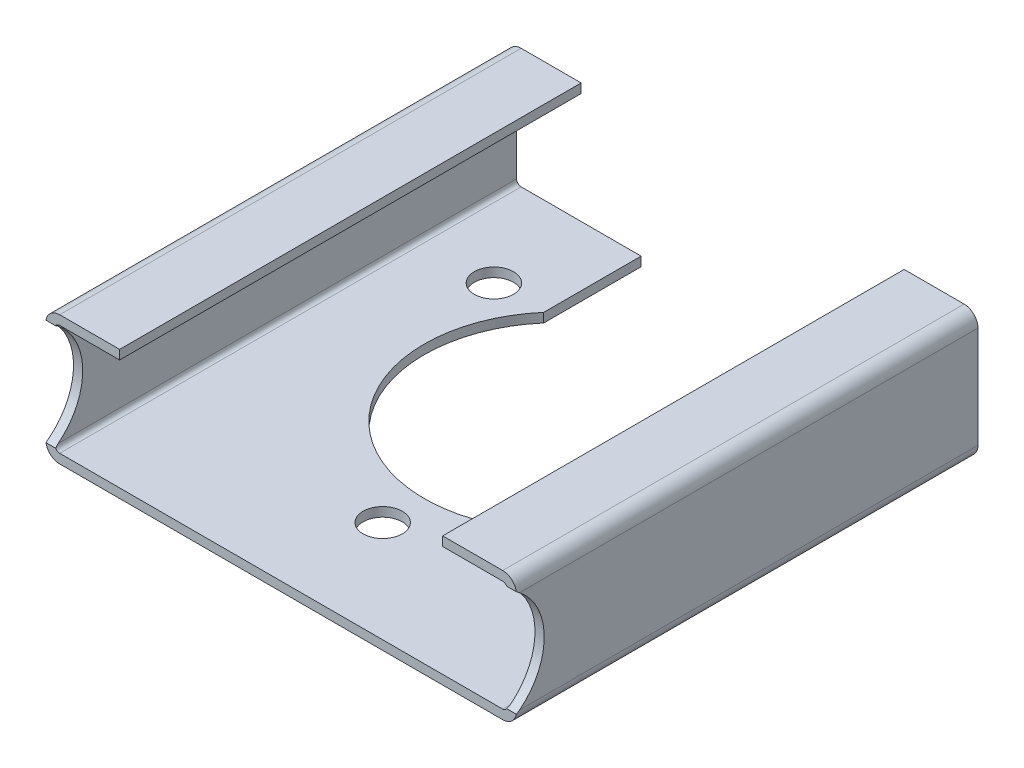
from build123d import *

# Parameters (mm, degrees)
BASE_EXTRUSION_DEPTH    = 100
ESQUISSE2_R             = 14
ENL_V_MAT_EXTRU_1_DEPTH = 146.560983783
ENL_V_MAT_EXTRU_2_REACH = 147.561
ESQUISSE3_R             = 4.25


with BuildPart() as part:
    # Esquisse1 → Base-Extrusion (new body)
    with BuildSketch(Plane.XY):
        with BuildLine():
            Line((2, 3), (2, 25))
            ThreePointArc((2, 25), (2.292893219, 25.707106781), (3, 26))
            Line((3, 26), (16, 26))
            Line((16, 26), (16, 28))
            Line((16, 28), (3, 28))
            ThreePointArc((3, 28), (0.878679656, 27.121320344), (0, 25))
            Line((0, 25), (0, 3))
            ThreePointArc((0, 3), (0.878679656, 0.878679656), (3, 0))
            Line((3, 0), (99, 0))
            ThreePointArc((99, 0), (101.121320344, 0.878679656), (102, 3))
            Line((102, 3), (102, 25))
            ThreePointArc((102, 25), (101.121320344, 27.121320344), (99, 28))
            Line((99, 28), (86, 28))
            Line((86, 28), (86, 26))
            Line((86, 26), (99, 26))
            ThreePointArc((99, 26), (99.707106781, 25.707106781), (100, 25))
            Line((100, 25), (100, 3))
            ThreePointArc((100, 3), (99.707106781, 2.292893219), (99, 2))
            Line((99, 2), (3, 2))
            ThreePointArc((3, 2), (2.292893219, 2.292893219), (2, 3))
        make_face()
    extrude(amount=-BASE_EXTRUSION_DEPTH)

    # Esquisse2 → Enl_v. mat.-Extru.1 (cut, through all)
    with BuildSketch(Plane(origin=(102, 0, 0), x_dir=(0, 0, -1), z_dir=(1, 0, 0))):
        with Locations((-8, 14)):
            Circle(ESQUISSE2_R)
    extrude(amount=-ENL_V_MAT_EXTRU_1_DEPTH, mode=Mode.SUBTRACT)

    # Esquisse3 → Enl_v. mat.-Extru.2 (cut, up to next)
    with BuildSketch(Plane.XZ, mode=Mode.PRIVATE) as enl_v_mat_extru_2_sk1:
        with Locations(Location((51, -22, 0), (0, 0, 270))):
            Circle(ESQUISSE3_R)
    enl_v_mat_extru_2_tool1 = extrude(enl_v_mat_extru_2_sk1.sketch, amount=-ENL_V_MAT_EXTRU_2_REACH, mode=Mode.PRIVATE) & part.part
    # Esquisse3 → Enl_v. mat.-Extru.2 (cut, up to next)
    with BuildSketch(Plane.XZ, mode=Mode.PRIVATE) as enl_v_mat_extru_2_sk2:
        with Locations(Location((83.908965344, -79, 0), (0, 0, 270))):
            Circle(ESQUISSE3_R)
    enl_v_mat_extru_2_tool2 = extrude(enl_v_mat_extru_2_sk2.sketch, amount=-ENL_V_MAT_EXTRU_2_REACH, mode=Mode.PRIVATE) & part.part
    # Esquisse3 → Enl_v. mat.-Extru.2 (cut, up to next)
    with BuildSketch(Plane.XZ, mode=Mode.PRIVATE) as enl_v_mat_extru_2_sk3:
        with Locations(Location((18.091034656, -79, 0), (0, 0, 270))):
            Circle(ESQUISSE3_R)
    enl_v_mat_extru_2_tool3 = extrude(enl_v_mat_extru_2_sk3.sketch, amount=-ENL_V_MAT_EXTRU_2_REACH, mode=Mode.PRIVATE) & part.part
    # Esquisse3 → Enl_v. mat.-Extru.2 (cut, up to next)
    with BuildSketch(Plane.XZ, mode=Mode.PRIVATE) as enl_v_mat_extru_2_sk4:
        with BuildLine():
            Line((29, -100), (73, -100))
            Line((73, -100), (73, -78.894443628))
            ThreePointArc((73, -78.894443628), (51, -31), (29, -78.894443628))
            Line((29, -78.894443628), (29, -100))
        make_face()
    enl_v_mat_extru_2_tool4 = extrude(enl_v_mat_extru_2_sk4.sketch, amount=-ENL_V_MAT_EXTRU_2_REACH, mode=Mode.PRIVATE) & part.part
    add(enl_v_mat_extru_2_tool1.solids().sort_by_distance((51, 0, -22))[0], mode=Mode.SUBTRACT)
    add(enl_v_mat_extru_2_tool2.solids().sort_by_distance((83.908965, 0, -79))[0], mode=Mode.SUBTRACT)
    add(enl_v_mat_extru_2_tool3.solids().sort_by_distance((18.091035, 0, -79))[0], mode=Mode.SUBTRACT)
    add(enl_v_mat_extru_2_tool4.solids().sort_by_distance((51, 0, -66.206768))[0], mode=Mode.SUBTRACT)


solid = part.part
